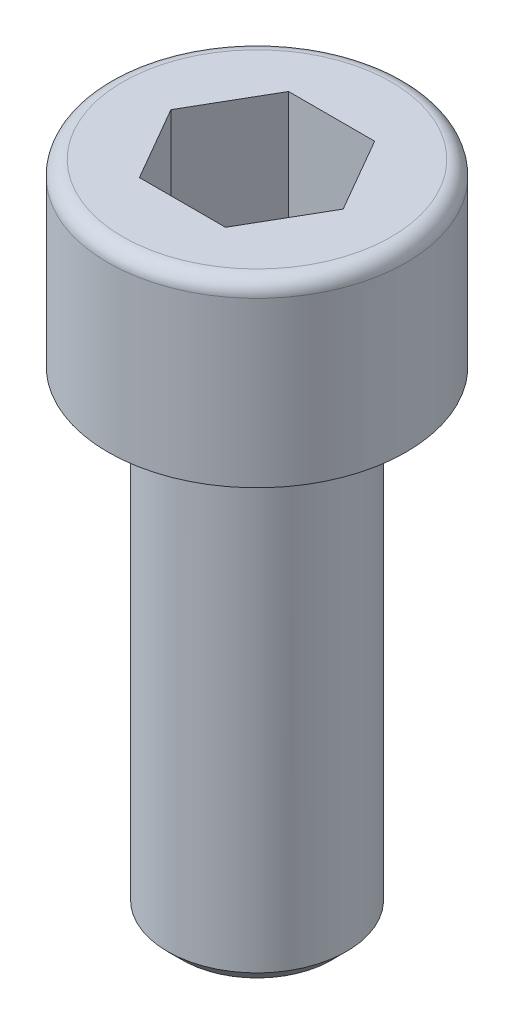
ISO-10303-21;
HEADER;
FILE_DESCRIPTION(('STEP AP214'),'2;1');
FILE_NAME('part.step','',(''),(''),'','','');
FILE_SCHEMA(('AUTOMOTIVE_DESIGN { 1 0 10303 214 1 1 1 1 }'));
ENDSEC;
DATA;
#1=APPLICATION_CONTEXT('core data for automotive mechanical design processes');
#2=APPLICATION_PROTOCOL_DEFINITION('international standard','automotive_design',2000,#1);
#3=PRODUCT_CONTEXT('',#1,'mechanical');
#4=PRODUCT('Part','Part','',(#3));
#5=PRODUCT_RELATED_PRODUCT_CATEGORY('part','',(#4));
#6=PRODUCT_DEFINITION_FORMATION('','',#4);
#7=PRODUCT_DEFINITION_CONTEXT('part definition',#1,'design');
#8=PRODUCT_DEFINITION('design','',#6,#7);
#9=PRODUCT_DEFINITION_SHAPE('','',#8);
#10=(LENGTH_UNIT() NAMED_UNIT(*) SI_UNIT(.MILLI.,.METRE.));
#11=(NAMED_UNIT(*) PLANE_ANGLE_UNIT() SI_UNIT($,.RADIAN.));
#12=(NAMED_UNIT(*) SI_UNIT($,.STERADIAN.) SOLID_ANGLE_UNIT());
#13=UNCERTAINTY_MEASURE_WITH_UNIT(LENGTH_MEASURE(1.E-05),#10,'distance_accuracy_value','');
#14=(GEOMETRIC_REPRESENTATION_CONTEXT(3) GLOBAL_UNCERTAINTY_ASSIGNED_CONTEXT((#13)) GLOBAL_UNIT_ASSIGNED_CONTEXT((#10,
#11,#12)) REPRESENTATION_CONTEXT('',''));
#15=CARTESIAN_POINT('',(0.,0.,0.));
#16=DIRECTION('',(0.,0.,1.));
#17=DIRECTION('',(1.,0.,0.));
#18=AXIS2_PLACEMENT_3D('',#15,#16,#17);
#19=CARTESIAN_POINT('',(3.33066907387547E-13,21.9999999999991,-9.99200722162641E-13));
#20=DIRECTION('',(0.,1.,0.));
#21=DIRECTION('',(0.,0.,1.));
#22=AXIS2_PLACEMENT_3D('',#19,#20,#21);
#23=PLANE('',#22);
#24=CARTESIAN_POINT('',(3.33066907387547E-13,21.9999999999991,-9.99200722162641E-13));
#25=DIRECTION('',(0.,1.,0.));
#26=DIRECTION('',(0.,0.,1.));
#27=AXIS2_PLACEMENT_3D('',#24,#25,#26);
#28=CIRCLE('',#27,4.5);
#29=CARTESIAN_POINT('',(3.34247925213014E-13,21.9999999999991,4.49999999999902));
#30=VERTEX_POINT('',#29);
#31=EDGE_CURVE('E97',#30,#30,#28,.T.);
#32=ORIENTED_EDGE('',*,*,#31,.T.);
#33=EDGE_LOOP('',(#32));
#34=FACE_BOUND('',#33,.T.);
#35=DIRECTION('',(0.500000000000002,0.,0.866025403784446));
#36=VECTOR('',#35,1.);
#37=CARTESIAN_POINT('',(1.4433756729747,21.9999999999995,-2.50000000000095));
#38=LINE('',#37,#36);
#39=CARTESIAN_POINT('',(1.4433756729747,21.9999999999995,-2.50000000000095));
#40=VERTEX_POINT('',#39);
#41=CARTESIAN_POINT('',(2.88675134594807,21.9999999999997,-6.66133814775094E-13));
#42=VERTEX_POINT('',#41);
#43=EDGE_CURVE('E102',#40,#42,#38,.T.);
#44=ORIENTED_EDGE('',*,*,#43,.T.);
#45=DIRECTION('',(-0.500000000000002,0.,0.866025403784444));
#46=VECTOR('',#45,1.);
#47=CARTESIAN_POINT('',(2.88675134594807,21.9999999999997,-6.66133814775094E-13));
#48=LINE('',#47,#46);
#49=CARTESIAN_POINT('',(1.44337567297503,22.0000000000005,2.49999999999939));
#50=VERTEX_POINT('',#49);
#51=EDGE_CURVE('E43',#42,#50,#48,.T.);
#52=ORIENTED_EDGE('',*,*,#51,.T.);
#53=DIRECTION('',(-1.,0.,0.));
#54=VECTOR('',#53,1.);
#55=CARTESIAN_POINT('',(1.44337567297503,22.0000000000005,2.49999999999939));
#56=LINE('',#55,#54);
#57=CARTESIAN_POINT('',(-1.44337567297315,21.9999999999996,2.49999999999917));
#58=VERTEX_POINT('',#57);
#59=EDGE_CURVE('E83',#50,#58,#56,.T.);
#60=ORIENTED_EDGE('',*,*,#59,.T.);
#61=DIRECTION('',(-0.500000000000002,0.,-0.866025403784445));
#62=VECTOR('',#61,1.);
#63=CARTESIAN_POINT('',(-1.44337567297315,21.9999999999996,2.49999999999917));
#64=LINE('',#63,#62);
#65=CARTESIAN_POINT('',(-2.8867513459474,21.9999999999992,-8.88178419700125E-13));
#66=VERTEX_POINT('',#65);
#67=EDGE_CURVE('E91',#58,#66,#64,.T.);
#68=ORIENTED_EDGE('',*,*,#67,.T.);
#69=DIRECTION('',(0.500000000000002,0.,-0.866025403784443));
#70=VECTOR('',#69,1.);
#71=CARTESIAN_POINT('',(-2.8867513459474,21.9999999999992,-8.88178419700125E-13));
#72=LINE('',#71,#70);
#73=CARTESIAN_POINT('',(-1.44337567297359,21.9999999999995,-2.50000000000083));
#74=VERTEX_POINT('',#73);
#75=EDGE_CURVE('E106',#66,#74,#72,.T.);
#76=ORIENTED_EDGE('',*,*,#75,.T.);
#77=DIRECTION('',(1.,0.,0.));
#78=VECTOR('',#77,1.);
#79=CARTESIAN_POINT('',(-1.44337567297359,21.9999999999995,-2.50000000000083));
#80=LINE('',#79,#78);
#81=EDGE_CURVE('E109',#74,#40,#80,.T.);
#82=ORIENTED_EDGE('',*,*,#81,.T.);
#83=EDGE_LOOP('',(#44,#52,#60,#68,#76,#82));
#84=FACE_BOUND('',#83,.T.);
#85=ADVANCED_FACE('F28',(#34,#84),#23,.T.);
#86=CARTESIAN_POINT('',(-3.00000000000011,-1.16573417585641E-12,-6.66133814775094E-13));
#87=DIRECTION('',(0.,-1.,0.));
#88=DIRECTION('',(0.,0.,-1.));
#89=AXIS2_PLACEMENT_3D('',#86,#87,#88);
#90=PLANE('',#89);
#91=CARTESIAN_POINT('',(0.,-2.22044604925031E-13,-2.22044604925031E-13));
#92=DIRECTION('',(0.,-1.,0.));
#93=DIRECTION('',(0.,0.,-1.));
#94=AXIS2_PLACEMENT_3D('',#91,#92,#93);
#95=CIRCLE('',#94,2.5);
#96=CARTESIAN_POINT('',(0.,-2.22086508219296E-13,-2.50000000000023));
#97=VERTEX_POINT('',#96);
#98=EDGE_CURVE('E11',#97,#97,#95,.T.);
#99=ORIENTED_EDGE('',*,*,#98,.T.);
#100=EDGE_LOOP('',(#99));
#101=FACE_BOUND('',#100,.T.);
#102=ADVANCED_FACE('F30',(#101),#90,.T.);
#103=CARTESIAN_POINT('',(0.,49.9999999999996,-4.44089209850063E-13));
#104=DIRECTION('',(0.,1.,0.));
#105=DIRECTION('',(0.,0.,1.));
#106=AXIS2_PLACEMENT_3D('',#103,#104,#105);
#107=CYLINDRICAL_SURFACE('',#106,3.);
#108=CARTESIAN_POINT('',(8.88178419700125E-13,0.499999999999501,-1.11022302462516E-13));
#109=DIRECTION('',(0.,-1.,0.));
#110=DIRECTION('',(0.,0.,-1.));
#111=AXIS2_PLACEMENT_3D('',#108,#109,#110);
#112=CIRCLE('',#111,3.);
#113=CARTESIAN_POINT('',(8.87391074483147E-13,0.499999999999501,-3.00000000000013));
#114=VERTEX_POINT('',#113);
#115=EDGE_CURVE('E36',#114,#114,#112,.F.);
#116=ORIENTED_EDGE('',*,*,#115,.T.);
#117=EDGE_LOOP('',(#116));
#118=FACE_BOUND('',#117,.T.);
#119=CARTESIAN_POINT('',(8.88178419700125E-13,15.9999999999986,-4.44089209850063E-13));
#120=DIRECTION('',(0.,1.,0.));
#121=DIRECTION('',(0.,0.,1.));
#122=AXIS2_PLACEMENT_3D('',#119,#120,#121);
#123=CIRCLE('',#122,3.);
#124=CARTESIAN_POINT('',(8.88965764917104E-13,15.9999999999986,2.99999999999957));
#125=VERTEX_POINT('',#124);
#126=EDGE_CURVE('E139',#125,#125,#123,.T.);
#127=ORIENTED_EDGE('',*,*,#126,.F.);
#128=EDGE_LOOP('',(#127));
#129=FACE_BOUND('',#128,.T.);
#130=ADVANCED_FACE('F144',(#118,#129),#107,.T.);
#131=CARTESIAN_POINT('',(-4.99999999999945,15.9999999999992,-6.66133814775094E-13));
#132=DIRECTION('',(0.,-1.,0.));
#133=DIRECTION('',(0.,0.,-1.));
#134=AXIS2_PLACEMENT_3D('',#131,#132,#133);
#135=PLANE('',#134);
#136=ORIENTED_EDGE('',*,*,#126,.T.);
#137=EDGE_LOOP('',(#136));
#138=FACE_BOUND('',#137,.T.);
#139=CARTESIAN_POINT('',(8.88178419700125E-13,15.9999999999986,-4.44089209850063E-13));
#140=DIRECTION('',(0.,1.,0.));
#141=DIRECTION('',(0.,0.,1.));
#142=AXIS2_PLACEMENT_3D('',#139,#140,#141);
#143=CIRCLE('',#142,5.);
#144=CARTESIAN_POINT('',(8.89490661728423E-13,15.9999999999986,4.99999999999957));
#145=VERTEX_POINT('',#144);
#146=EDGE_CURVE('E136',#145,#145,#143,.T.);
#147=ORIENTED_EDGE('',*,*,#146,.F.);
#148=EDGE_LOOP('',(#147));
#149=FACE_BOUND('',#148,.T.);
#150=ADVANCED_FACE('F176',(#138,#149),#135,.T.);
#151=CARTESIAN_POINT('',(0.,49.9999999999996,-4.44089209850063E-13));
#152=DIRECTION('',(0.,1.,0.));
#153=DIRECTION('',(0.,0.,1.));
#154=AXIS2_PLACEMENT_3D('',#151,#152,#153);
#155=CYLINDRICAL_SURFACE('',#154,5.);
#156=ORIENTED_EDGE('',*,*,#146,.T.);
#157=EDGE_LOOP('',(#156));
#158=FACE_BOUND('',#157,.T.);
#159=CARTESIAN_POINT('',(-3.33066907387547E-13,21.4999999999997,-5.55111512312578E-13));
#160=DIRECTION('',(0.,1.,0.));
#161=DIRECTION('',(0.,0.,1.));
#162=AXIS2_PLACEMENT_3D('',#159,#160,#161);
#163=CIRCLE('',#162,5.);
#164=CARTESIAN_POINT('',(-3.3175466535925E-13,21.4999999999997,4.99999999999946));
#165=VERTEX_POINT('',#164);
#166=EDGE_CURVE('E133',#165,#165,#163,.T.);
#167=ORIENTED_EDGE('',*,*,#166,.F.);
#168=EDGE_LOOP('',(#167));
#169=FACE_BOUND('',#168,.T.);
#170=ADVANCED_FACE('F172',(#158,#169),#155,.T.);
#171=CARTESIAN_POINT('',(-3.33066907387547E-13,21.4999999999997,-5.55111512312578E-13));
#172=DIRECTION('',(0.,1.,0.));
#173=DIRECTION('',(0.,0.,1.));
#174=AXIS2_PLACEMENT_3D('',#171,#172,#173);
#175=TOROIDAL_SURFACE('',#174,4.5,0.5);
#176=ORIENTED_EDGE('',*,*,#31,.F.);
#177=EDGE_LOOP('',(#176));
#178=FACE_BOUND('',#177,.T.);
#179=ORIENTED_EDGE('',*,*,#166,.T.);
#180=EDGE_LOOP('',(#179));
#181=FACE_BOUND('',#180,.T.);
#182=ADVANCED_FACE('F169',(#178,#181),#175,.T.);
#183=CARTESIAN_POINT('',(2.88675134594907,16.9999999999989,-4.44089209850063E-13));
#184=DIRECTION('',(-0.866025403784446,0.,-0.500000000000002));
#185=DIRECTION('',(-0.500000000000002,0.,0.866025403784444));
#186=AXIS2_PLACEMENT_3D('',#183,#184,#185);
#187=PLANE('',#186);
#188=ORIENTED_EDGE('',*,*,#51,.F.);
#189=DIRECTION('',(0.,1.,0.));
#190=VECTOR('',#189,1.);
#191=CARTESIAN_POINT('',(2.88675134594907,16.9999999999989,-4.44089209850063E-13));
#192=LINE('',#191,#190);
#193=CARTESIAN_POINT('',(2.88675134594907,16.9999999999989,-4.44089209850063E-13));
#194=VERTEX_POINT('',#193);
#195=EDGE_CURVE('E122',#194,#42,#192,.T.);
#196=ORIENTED_EDGE('',*,*,#195,.F.);
#197=DIRECTION('',(-0.500000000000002,0.,0.866025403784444));
#198=VECTOR('',#197,1.);
#199=CARTESIAN_POINT('',(2.88675134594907,16.9999999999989,-4.44089209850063E-13));
#200=LINE('',#199,#198);
#201=CARTESIAN_POINT('',(1.44337567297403,16.9999999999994,2.49999999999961));
#202=VERTEX_POINT('',#201);
#203=EDGE_CURVE('E96',#194,#202,#200,.T.);
#204=ORIENTED_EDGE('',*,*,#203,.T.);
#205=DIRECTION('',(0.,1.,0.));
#206=VECTOR('',#205,1.);
#207=CARTESIAN_POINT('',(1.44337567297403,16.9999999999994,2.49999999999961));
#208=LINE('',#207,#206);
#209=EDGE_CURVE('E85',#202,#50,#208,.T.);
#210=ORIENTED_EDGE('',*,*,#209,.T.);
#211=EDGE_LOOP('',(#188,#196,#204,#210));
#212=FACE_BOUND('',#211,.T.);
#213=ADVANCED_FACE('F94',(#212),#187,.T.);
#214=CARTESIAN_POINT('',(1.44337567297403,16.9999999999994,2.49999999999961));
#215=DIRECTION('',(0.,0.,-1.));
#216=DIRECTION('',(-1.,0.,0.));
#217=AXIS2_PLACEMENT_3D('',#214,#215,#216);
#218=PLANE('',#217);
#219=ORIENTED_EDGE('',*,*,#59,.F.);
#220=ORIENTED_EDGE('',*,*,#209,.F.);
#221=DIRECTION('',(-1.,0.,0.));
#222=VECTOR('',#221,1.);
#223=CARTESIAN_POINT('',(1.44337567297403,16.9999999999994,2.49999999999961));
#224=LINE('',#223,#222);
#225=CARTESIAN_POINT('',(-1.4433756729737,16.9999999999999,2.49999999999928));
#226=VERTEX_POINT('',#225);
#227=EDGE_CURVE('E113',#202,#226,#224,.T.);
#228=ORIENTED_EDGE('',*,*,#227,.T.);
#229=DIRECTION('',(0.,1.,0.));
#230=VECTOR('',#229,1.);
#231=CARTESIAN_POINT('',(-1.4433756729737,16.9999999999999,2.49999999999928));
#232=LINE('',#231,#230);
#233=EDGE_CURVE('E87',#226,#58,#232,.T.);
#234=ORIENTED_EDGE('',*,*,#233,.T.);
#235=EDGE_LOOP('',(#219,#220,#228,#234));
#236=FACE_BOUND('',#235,.T.);
#237=ADVANCED_FACE('F84',(#236),#218,.T.);
#238=CARTESIAN_POINT('',(-1.4433756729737,16.9999999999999,2.49999999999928));
#239=DIRECTION('',(0.866025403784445,0.,-0.500000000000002));
#240=DIRECTION('',(-0.500000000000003,0.,-0.866025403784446));
#241=AXIS2_PLACEMENT_3D('',#238,#239,#240);
#242=PLANE('',#241);
#243=ORIENTED_EDGE('',*,*,#67,.F.);
#244=ORIENTED_EDGE('',*,*,#233,.F.);
#245=DIRECTION('',(-0.500000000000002,0.,-0.866025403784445));
#246=VECTOR('',#245,1.);
#247=CARTESIAN_POINT('',(-1.4433756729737,16.9999999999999,2.49999999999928));
#248=LINE('',#247,#246);
#249=CARTESIAN_POINT('',(-2.88675134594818,16.9999999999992,-7.7715611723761E-13));
#250=VERTEX_POINT('',#249);
#251=EDGE_CURVE('E115',#226,#250,#248,.T.);
#252=ORIENTED_EDGE('',*,*,#251,.T.);
#253=DIRECTION('',(0.,1.,0.));
#254=VECTOR('',#253,1.);
#255=CARTESIAN_POINT('',(-2.88675134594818,16.9999999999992,-7.7715611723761E-13));
#256=LINE('',#255,#254);
#257=EDGE_CURVE('E128',#250,#66,#256,.T.);
#258=ORIENTED_EDGE('',*,*,#257,.T.);
#259=EDGE_LOOP('',(#243,#244,#252,#258));
#260=FACE_BOUND('',#259,.T.);
#261=ADVANCED_FACE('F208',(#260),#242,.T.);
#262=CARTESIAN_POINT('',(-2.88675134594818,16.9999999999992,-7.7715611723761E-13));
#263=DIRECTION('',(0.866025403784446,0.,0.500000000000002));
#264=DIRECTION('',(0.500000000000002,0.,-0.866025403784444));
#265=AXIS2_PLACEMENT_3D('',#262,#263,#264);
#266=PLANE('',#265);
#267=ORIENTED_EDGE('',*,*,#75,.F.);
#268=ORIENTED_EDGE('',*,*,#257,.F.);
#269=DIRECTION('',(0.500000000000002,0.,-0.866025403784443));
#270=VECTOR('',#269,1.);
#271=CARTESIAN_POINT('',(-2.88675134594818,16.9999999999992,-7.7715611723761E-13));
#272=LINE('',#271,#270);
#273=CARTESIAN_POINT('',(-1.44337567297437,17.0000000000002,-2.50000000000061));
#274=VERTEX_POINT('',#273);
#275=EDGE_CURVE('E117',#250,#274,#272,.T.);
#276=ORIENTED_EDGE('',*,*,#275,.T.);
#277=DIRECTION('',(0.,1.,0.));
#278=VECTOR('',#277,1.);
#279=CARTESIAN_POINT('',(-1.44337567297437,17.0000000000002,-2.50000000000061));
#280=LINE('',#279,#278);
#281=EDGE_CURVE('E126',#274,#74,#280,.T.);
#282=ORIENTED_EDGE('',*,*,#281,.T.);
#283=EDGE_LOOP('',(#267,#268,#276,#282));
#284=FACE_BOUND('',#283,.T.);
#285=ADVANCED_FACE('F214',(#284),#266,.T.);
#286=CARTESIAN_POINT('',(-1.44337567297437,17.0000000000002,-2.50000000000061));
#287=DIRECTION('',(0.,0.,1.));
#288=DIRECTION('',(1.,0.,0.));
#289=AXIS2_PLACEMENT_3D('',#286,#287,#288);
#290=PLANE('',#289);
#291=ORIENTED_EDGE('',*,*,#81,.F.);
#292=ORIENTED_EDGE('',*,*,#281,.F.);
#293=DIRECTION('',(1.,0.,0.));
#294=VECTOR('',#293,1.);
#295=CARTESIAN_POINT('',(-1.44337567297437,17.0000000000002,-2.50000000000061));
#296=LINE('',#295,#294);
#297=CARTESIAN_POINT('',(1.44337567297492,16.9999999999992,-2.50000000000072));
#298=VERTEX_POINT('',#297);
#299=EDGE_CURVE('E119',#274,#298,#296,.T.);
#300=ORIENTED_EDGE('',*,*,#299,.T.);
#301=DIRECTION('',(0.,1.,0.));
#302=VECTOR('',#301,1.);
#303=CARTESIAN_POINT('',(1.44337567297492,16.9999999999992,-2.50000000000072));
#304=LINE('',#303,#302);
#305=EDGE_CURVE('E124',#298,#40,#304,.T.);
#306=ORIENTED_EDGE('',*,*,#305,.T.);
#307=EDGE_LOOP('',(#291,#292,#300,#306));
#308=FACE_BOUND('',#307,.T.);
#309=ADVANCED_FACE('F222',(#308),#290,.T.);
#310=CARTESIAN_POINT('',(1.44337567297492,16.9999999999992,-2.50000000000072));
#311=DIRECTION('',(-0.866025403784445,0.,0.500000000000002));
#312=DIRECTION('',(0.500000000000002,0.,0.866025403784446));
#313=AXIS2_PLACEMENT_3D('',#310,#311,#312);
#314=PLANE('',#313);
#315=ORIENTED_EDGE('',*,*,#43,.F.);
#316=ORIENTED_EDGE('',*,*,#305,.F.);
#317=DIRECTION('',(0.500000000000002,0.,0.866025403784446));
#318=VECTOR('',#317,1.);
#319=CARTESIAN_POINT('',(1.44337567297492,16.9999999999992,-2.50000000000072));
#320=LINE('',#319,#318);
#321=EDGE_CURVE('E50',#298,#194,#320,.T.);
#322=ORIENTED_EDGE('',*,*,#321,.T.);
#323=ORIENTED_EDGE('',*,*,#195,.T.);
#324=EDGE_LOOP('',(#315,#316,#322,#323));
#325=FACE_BOUND('',#324,.T.);
#326=ADVANCED_FACE('F155',(#325),#314,.T.);
#327=CARTESIAN_POINT('',(2.22044604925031E-13,16.9999999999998,4.99999999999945));
#328=DIRECTION('',(0.,-1.,0.));
#329=DIRECTION('',(0.,0.,-1.));
#330=AXIS2_PLACEMENT_3D('',#327,#328,#329);
#331=PLANE('',#330);
#332=ORIENTED_EDGE('',*,*,#203,.F.);
#333=ORIENTED_EDGE('',*,*,#321,.F.);
#334=ORIENTED_EDGE('',*,*,#299,.F.);
#335=ORIENTED_EDGE('',*,*,#275,.F.);
#336=ORIENTED_EDGE('',*,*,#251,.F.);
#337=ORIENTED_EDGE('',*,*,#227,.F.);
#338=EDGE_LOOP('',(#332,#333,#334,#335,#336,#337));
#339=FACE_BOUND('',#338,.T.);
#340=ADVANCED_FACE('F149',(#339),#331,.F.);
#341=CARTESIAN_POINT('',(8.88178419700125E-13,0.499999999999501,-1.11022302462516E-13));
#342=DIRECTION('',(0.,1.,0.));
#343=DIRECTION('',(0.,0.,1.));
#344=AXIS2_PLACEMENT_3D('',#341,#342,#343);
#345=CONICAL_SURFACE('',#344,3.,0.785398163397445);
#346=ORIENTED_EDGE('',*,*,#98,.F.);
#347=EDGE_LOOP('',(#346));
#348=FACE_BOUND('',#347,.T.);
#349=ORIENTED_EDGE('',*,*,#115,.F.);
#350=EDGE_LOOP('',(#349));
#351=FACE_BOUND('',#350,.T.);
#352=ADVANCED_FACE('F147',(#348,#351),#345,.T.);
#353=CLOSED_SHELL('',(#85,#102,#130,#150,#170,#182,#213,#237,#261,#285,#309,#326,#340,#352));
#354=MANIFOLD_SOLID_BREP('B2',#353);
#355=ADVANCED_BREP_SHAPE_REPRESENTATION('',(#18,#354),#14);
#356=SHAPE_DEFINITION_REPRESENTATION(#9,#355);
ENDSEC;
END-ISO-10303-21;
